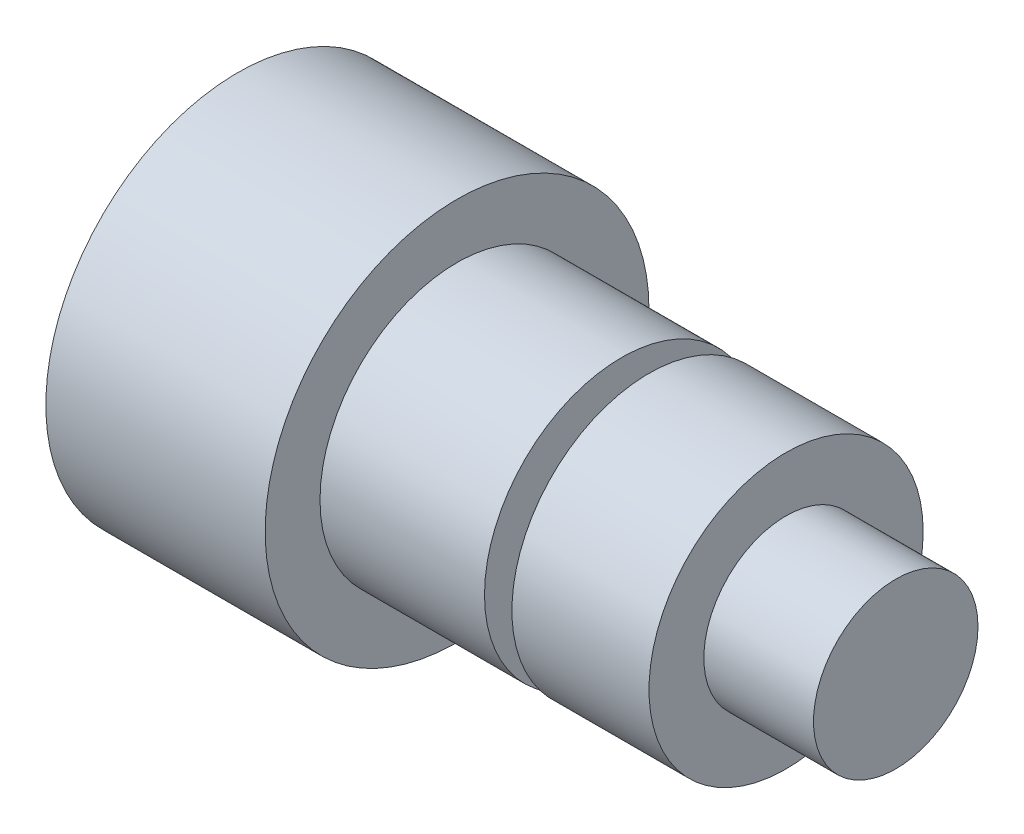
from build123d import *

# Parameters (mm, degrees)
SKETCH1_R           = 44.45
BASE_EXTRUDE_DEPTH  = 50.8
SKETCH2_R           = 31.75
BOSS_EXTRUDE1_DEPTH = 38.1
SKETCH3_R           = 22.225
BOSS_EXTRUDE2_DEPTH = 6.35
SKETCH4_R           = 31.75
BOSS_EXTRUDE3_DEPTH = 31.75
SKETCH5_R           = 19.05
BOSS_EXTRUDE4_DEPTH = 25.4


with BuildPart() as part:
    # Sketch1 → Base-Extrude (new body)
    with BuildSketch(Plane(origin=(0, 0, 0), x_dir=(0, 0, -1), z_dir=(1, 0, 0))):
        Circle(SKETCH1_R)
    extrude(amount=BASE_EXTRUDE_DEPTH)

    # Sketch2 → Boss-Extrude1 (add)
    with BuildSketch(Plane(origin=(50.8, 0, 0), x_dir=(0, 0, -1), z_dir=(1, 0, 0))):
        with Locations(Location((0, 0, 0), (0, 0, 180))):
            Circle(SKETCH2_R)
    extrude(amount=BOSS_EXTRUDE1_DEPTH)

    # Sketch3 → Boss-Extrude2 (add)
    with BuildSketch(Plane(origin=(88.9, 0, 0), x_dir=(0, 0, -1), z_dir=(1, 0, 0))):
        Circle(SKETCH3_R)
    extrude(amount=BOSS_EXTRUDE2_DEPTH)

    # Sketch4 → Boss-Extrude3 (add)
    with BuildSketch(Plane(origin=(95.25, 0, 0), x_dir=(0, 0, -1), z_dir=(1, 0, 0))):
        with Locations(Location((0, 0, 0), (0, 0, 180))):
            Circle(SKETCH4_R)
    extrude(amount=BOSS_EXTRUDE3_DEPTH)

    # Sketch5 → Boss-Extrude4 (add)
    with BuildSketch(Plane(origin=(127, 0, 0), x_dir=(0, 0, -1), z_dir=(1, 0, 0))):
        Circle(SKETCH5_R)
    extrude(amount=BOSS_EXTRUDE4_DEPTH)


solid = part.part
